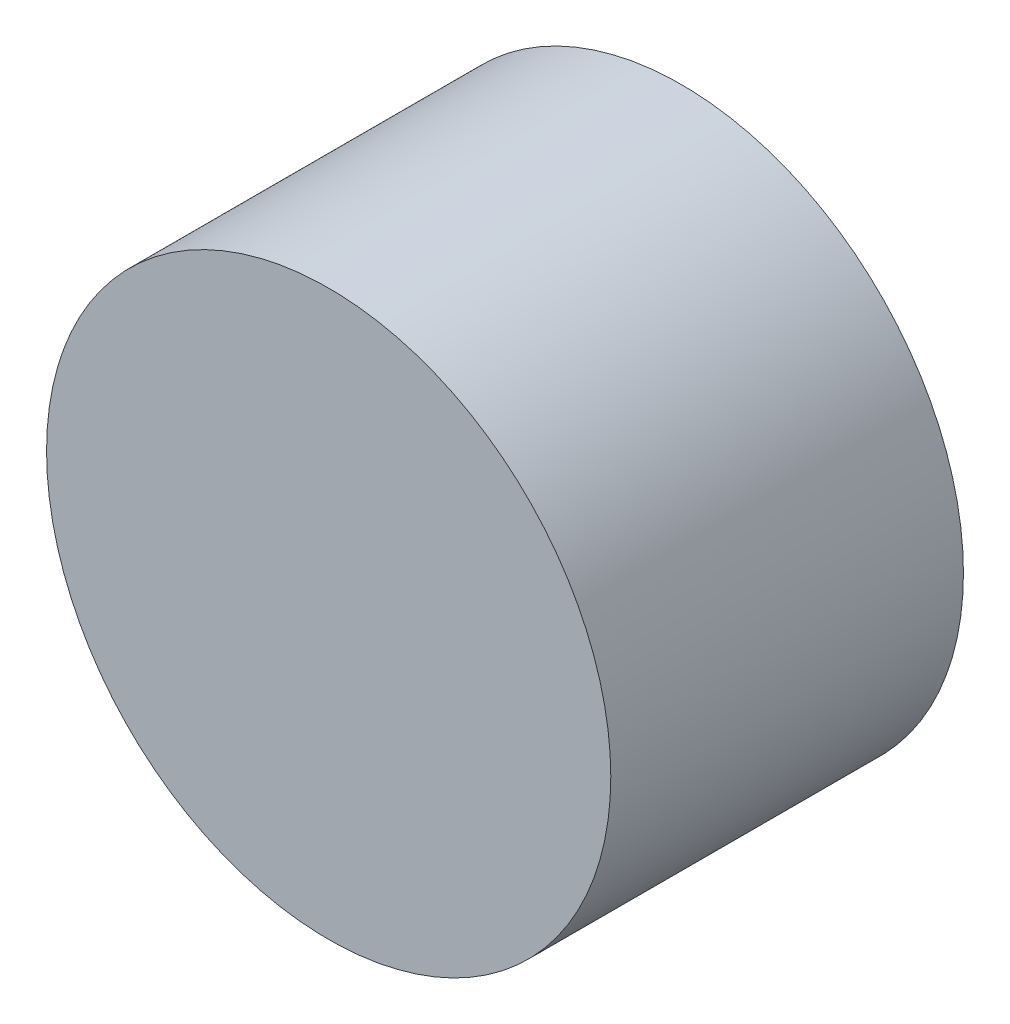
ISO-10303-21;
HEADER;
FILE_DESCRIPTION(('STEP AP214'),'2;1');
FILE_NAME('part.step','',(''),(''),'','','');
FILE_SCHEMA(('AUTOMOTIVE_DESIGN { 1 0 10303 214 1 1 1 1 }'));
ENDSEC;
DATA;
#1=APPLICATION_CONTEXT('core data for automotive mechanical design processes');
#2=APPLICATION_PROTOCOL_DEFINITION('international standard','automotive_design',2000,#1);
#3=PRODUCT_CONTEXT('',#1,'mechanical');
#4=PRODUCT('Part','Part','',(#3));
#5=PRODUCT_RELATED_PRODUCT_CATEGORY('part','',(#4));
#6=PRODUCT_DEFINITION_FORMATION('','',#4);
#7=PRODUCT_DEFINITION_CONTEXT('part definition',#1,'design');
#8=PRODUCT_DEFINITION('design','',#6,#7);
#9=PRODUCT_DEFINITION_SHAPE('','',#8);
#10=(LENGTH_UNIT() NAMED_UNIT(*) SI_UNIT(.MILLI.,.METRE.));
#11=(NAMED_UNIT(*) PLANE_ANGLE_UNIT() SI_UNIT($,.RADIAN.));
#12=(NAMED_UNIT(*) SI_UNIT($,.STERADIAN.) SOLID_ANGLE_UNIT());
#13=UNCERTAINTY_MEASURE_WITH_UNIT(LENGTH_MEASURE(1.E-05),#10,'distance_accuracy_value','');
#14=(GEOMETRIC_REPRESENTATION_CONTEXT(3) GLOBAL_UNCERTAINTY_ASSIGNED_CONTEXT((#13)) GLOBAL_UNIT_ASSIGNED_CONTEXT((#10,
#11,#12)) REPRESENTATION_CONTEXT('',''));
#15=CARTESIAN_POINT('',(0.,0.,0.));
#16=DIRECTION('',(0.,0.,1.));
#17=DIRECTION('',(1.,0.,0.));
#18=AXIS2_PLACEMENT_3D('',#15,#16,#17);
#19=CARTESIAN_POINT('',(0.,0.,0.));
#20=DIRECTION('',(0.,0.,1.));
#21=DIRECTION('',(1.,0.,0.));
#22=AXIS2_PLACEMENT_3D('',#19,#20,#21);
#23=PLANE('',#22);
#24=CARTESIAN_POINT('',(0.,0.,0.));
#25=DIRECTION('',(0.,0.,1.));
#26=DIRECTION('',(1.,0.,0.));
#27=AXIS2_PLACEMENT_3D('',#24,#25,#26);
#28=CIRCLE('',#27,20.);
#29=CARTESIAN_POINT('',(20.,0.,0.));
#30=VERTEX_POINT('',#29);
#31=EDGE_CURVE('E10',#30,#30,#28,.T.);
#32=ORIENTED_EDGE('',*,*,#31,.F.);
#33=EDGE_LOOP('',(#32));
#34=FACE_BOUND('',#33,.T.);
#35=CARTESIAN_POINT('',(0.,15.,0.));
#36=DIRECTION('',(0.,0.,1.));
#37=DIRECTION('',(1.,0.,0.));
#38=AXIS2_PLACEMENT_3D('',#35,#36,#37);
#39=CIRCLE('',#38,2.5);
#40=CARTESIAN_POINT('',(2.5,15.,0.));
#41=VERTEX_POINT('',#40);
#42=EDGE_CURVE('E39',#41,#41,#39,.T.);
#43=ORIENTED_EDGE('',*,*,#42,.T.);
#44=EDGE_LOOP('',(#43));
#45=FACE_BOUND('',#44,.T.);
#46=CARTESIAN_POINT('',(0.,5.,0.));
#47=DIRECTION('',(0.,0.,1.));
#48=DIRECTION('',(1.,0.,0.));
#49=AXIS2_PLACEMENT_3D('',#46,#47,#48);
#50=CIRCLE('',#49,2.5);
#51=CARTESIAN_POINT('',(2.5,5.,0.));
#52=VERTEX_POINT('',#51);
#53=EDGE_CURVE('E43',#52,#52,#50,.T.);
#54=ORIENTED_EDGE('',*,*,#53,.T.);
#55=EDGE_LOOP('',(#54));
#56=FACE_BOUND('',#55,.T.);
#57=CARTESIAN_POINT('',(10.6066017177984,10.6066017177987,0.));
#58=DIRECTION('',(0.,0.,1.));
#59=DIRECTION('',(1.,0.,0.));
#60=AXIS2_PLACEMENT_3D('',#57,#58,#59);
#61=CIRCLE('',#60,2.50000000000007);
#62=CARTESIAN_POINT('',(13.1066017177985,10.6066017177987,0.));
#63=VERTEX_POINT('',#62);
#64=EDGE_CURVE('E47',#63,#63,#61,.T.);
#65=ORIENTED_EDGE('',*,*,#64,.T.);
#66=EDGE_LOOP('',(#65));
#67=FACE_BOUND('',#66,.T.);
#68=CARTESIAN_POINT('',(15.0000000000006,6.37821527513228E-13,0.));
#69=DIRECTION('',(0.,0.,1.));
#70=DIRECTION('',(1.,0.,0.));
#71=AXIS2_PLACEMENT_3D('',#68,#69,#70);
#72=CIRCLE('',#71,2.50000000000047);
#73=CARTESIAN_POINT('',(17.5000000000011,6.37821527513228E-13,0.));
#74=VERTEX_POINT('',#73);
#75=EDGE_CURVE('E60',#74,#74,#72,.T.);
#76=ORIENTED_EDGE('',*,*,#75,.T.);
#77=EDGE_LOOP('',(#76));
#78=FACE_BOUND('',#77,.T.);
#79=CARTESIAN_POINT('',(10.6066017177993,-10.6066017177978,0.));
#80=DIRECTION('',(0.,0.,1.));
#81=DIRECTION('',(1.,0.,0.));
#82=AXIS2_PLACEMENT_3D('',#79,#80,#81);
#83=CIRCLE('',#82,2.50000000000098);
#84=CARTESIAN_POINT('',(13.1066017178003,-10.6066017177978,0.));
#85=VERTEX_POINT('',#84);
#86=EDGE_CURVE('E66',#85,#85,#83,.T.);
#87=ORIENTED_EDGE('',*,*,#86,.T.);
#88=EDGE_LOOP('',(#87));
#89=FACE_BOUND('',#88,.T.);
#90=CARTESIAN_POINT('',(1.27564305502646E-12,-15.,0.));
#91=DIRECTION('',(0.,0.,1.));
#92=DIRECTION('',(1.,0.,0.));
#93=AXIS2_PLACEMENT_3D('',#90,#91,#92);
#94=CIRCLE('',#93,2.50000000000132);
#95=CARTESIAN_POINT('',(2.50000000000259,-15.,0.));
#96=VERTEX_POINT('',#95);
#97=EDGE_CURVE('E72',#96,#96,#94,.T.);
#98=ORIENTED_EDGE('',*,*,#97,.T.);
#99=EDGE_LOOP('',(#98));
#100=FACE_BOUND('',#99,.T.);
#101=CARTESIAN_POINT('',(-10.6066017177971,-10.6066017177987,0.));
#102=DIRECTION('',(0.,0.,1.));
#103=DIRECTION('',(1.,0.,0.));
#104=AXIS2_PLACEMENT_3D('',#101,#102,#103);
#105=CIRCLE('',#104,2.5000000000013);
#106=CARTESIAN_POINT('',(-8.10660171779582,-10.6066017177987,0.));
#107=VERTEX_POINT('',#106);
#108=EDGE_CURVE('E78',#107,#107,#105,.T.);
#109=ORIENTED_EDGE('',*,*,#108,.T.);
#110=EDGE_LOOP('',(#109));
#111=FACE_BOUND('',#110,.T.);
#112=CARTESIAN_POINT('',(-14.9999999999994,-6.39658497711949E-13,0.));
#113=DIRECTION('',(0.,0.,1.));
#114=DIRECTION('',(1.,0.,0.));
#115=AXIS2_PLACEMENT_3D('',#112,#113,#114);
#116=CIRCLE('',#115,2.50000000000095);
#117=CARTESIAN_POINT('',(-12.4999999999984,-6.39658497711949E-13,0.));
#118=VERTEX_POINT('',#117);
#119=EDGE_CURVE('E84',#118,#118,#116,.T.);
#120=ORIENTED_EDGE('',*,*,#119,.T.);
#121=EDGE_LOOP('',(#120));
#122=FACE_BOUND('',#121,.T.);
#123=CARTESIAN_POINT('',(-10.606601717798,10.6066017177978,0.));
#124=DIRECTION('',(0.,0.,1.));
#125=DIRECTION('',(1.,0.,0.));
#126=AXIS2_PLACEMENT_3D('',#123,#124,#125);
#127=CIRCLE('',#126,2.50000000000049);
#128=CARTESIAN_POINT('',(-8.10660171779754,10.6066017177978,0.));
#129=VERTEX_POINT('',#128);
#130=EDGE_CURVE('E90',#129,#129,#127,.T.);
#131=ORIENTED_EDGE('',*,*,#130,.T.);
#132=EDGE_LOOP('',(#131));
#133=FACE_BOUND('',#132,.T.);
#134=CARTESIAN_POINT('',(5.,0.,0.));
#135=DIRECTION('',(0.,0.,1.));
#136=DIRECTION('',(1.,0.,0.));
#137=AXIS2_PLACEMENT_3D('',#134,#135,#136);
#138=CIRCLE('',#137,2.5);
#139=CARTESIAN_POINT('',(7.5,0.,0.));
#140=VERTEX_POINT('',#139);
#141=EDGE_CURVE('E96',#140,#140,#138,.T.);
#142=ORIENTED_EDGE('',*,*,#141,.T.);
#143=EDGE_LOOP('',(#142));
#144=FACE_BOUND('',#143,.T.);
#145=CARTESIAN_POINT('',(0.,-5.,0.));
#146=DIRECTION('',(0.,0.,1.));
#147=DIRECTION('',(1.,0.,0.));
#148=AXIS2_PLACEMENT_3D('',#145,#146,#147);
#149=CIRCLE('',#148,2.5);
#150=CARTESIAN_POINT('',(2.49999999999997,-5.,0.));
#151=VERTEX_POINT('',#150);
#152=EDGE_CURVE('E102',#151,#151,#149,.T.);
#153=ORIENTED_EDGE('',*,*,#152,.T.);
#154=EDGE_LOOP('',(#153));
#155=FACE_BOUND('',#154,.T.);
#156=CARTESIAN_POINT('',(-5.,0.,0.));
#157=DIRECTION('',(0.,0.,1.));
#158=DIRECTION('',(1.,0.,0.));
#159=AXIS2_PLACEMENT_3D('',#156,#157,#158);
#160=CIRCLE('',#159,2.5);
#161=CARTESIAN_POINT('',(-2.5,0.,0.));
#162=VERTEX_POINT('',#161);
#163=EDGE_CURVE('E108',#162,#162,#160,.T.);
#164=ORIENTED_EDGE('',*,*,#163,.T.);
#165=EDGE_LOOP('',(#164));
#166=FACE_BOUND('',#165,.T.);
#167=ADVANCED_FACE('F32',(#34,#45,#56,#67,#78,#89,#100,#111,#122,#133,#144,#155,#166),#23,.F.);
#168=CARTESIAN_POINT('',(0.,0.,10.));
#169=DIRECTION('',(0.,0.,-1.));
#170=DIRECTION('',(-1.,0.,0.));
#171=AXIS2_PLACEMENT_3D('',#168,#169,#170);
#172=CYLINDRICAL_SURFACE('',#171,20.);
#173=ORIENTED_EDGE('',*,*,#31,.T.);
#174=EDGE_LOOP('',(#173));
#175=FACE_BOUND('',#174,.T.);
#176=CARTESIAN_POINT('',(0.,0.,25.));
#177=DIRECTION('',(0.,0.,1.));
#178=DIRECTION('',(1.,0.,0.));
#179=AXIS2_PLACEMENT_3D('',#176,#177,#178);
#180=CIRCLE('',#179,20.);
#181=CARTESIAN_POINT('',(20.,0.,25.));
#182=VERTEX_POINT('',#181);
#183=EDGE_CURVE('E115',#182,#182,#180,.T.);
#184=ORIENTED_EDGE('',*,*,#183,.F.);
#185=EDGE_LOOP('',(#184));
#186=FACE_BOUND('',#185,.T.);
#187=ADVANCED_FACE('F34',(#175,#186),#172,.T.);
#188=CARTESIAN_POINT('',(0.,15.,10.));
#189=DIRECTION('',(0.,0.,-1.));
#190=DIRECTION('',(-1.,0.,0.));
#191=AXIS2_PLACEMENT_3D('',#188,#189,#190);
#192=CYLINDRICAL_SURFACE('',#191,2.5);
#193=CARTESIAN_POINT('',(0.,15.,10.));
#194=DIRECTION('',(0.,0.,1.));
#195=DIRECTION('',(1.,0.,0.));
#196=AXIS2_PLACEMENT_3D('',#193,#194,#195);
#197=CIRCLE('',#196,2.5);
#198=CARTESIAN_POINT('',(2.5,15.,10.));
#199=VERTEX_POINT('',#198);
#200=EDGE_CURVE('E50',#199,#199,#197,.T.);
#201=ORIENTED_EDGE('',*,*,#200,.T.);
#202=EDGE_LOOP('',(#201));
#203=FACE_BOUND('',#202,.T.);
#204=ORIENTED_EDGE('',*,*,#42,.F.);
#205=EDGE_LOOP('',(#204));
#206=FACE_BOUND('',#205,.T.);
#207=ADVANCED_FACE('F122',(#203,#206),#192,.F.);
#208=CARTESIAN_POINT('',(0.,5.,10.));
#209=DIRECTION('',(0.,0.,-1.));
#210=DIRECTION('',(-1.,0.,0.));
#211=AXIS2_PLACEMENT_3D('',#208,#209,#210);
#212=CYLINDRICAL_SURFACE('',#211,2.5);
#213=CARTESIAN_POINT('',(0.,5.,10.));
#214=DIRECTION('',(0.,0.,1.));
#215=DIRECTION('',(1.,0.,0.));
#216=AXIS2_PLACEMENT_3D('',#213,#214,#215);
#217=CIRCLE('',#216,2.5);
#218=CARTESIAN_POINT('',(2.5,5.,10.));
#219=VERTEX_POINT('',#218);
#220=EDGE_CURVE('E53',#219,#219,#217,.T.);
#221=ORIENTED_EDGE('',*,*,#220,.T.);
#222=EDGE_LOOP('',(#221));
#223=FACE_BOUND('',#222,.T.);
#224=ORIENTED_EDGE('',*,*,#53,.F.);
#225=EDGE_LOOP('',(#224));
#226=FACE_BOUND('',#225,.T.);
#227=ADVANCED_FACE('F127',(#223,#226),#212,.F.);
#228=CARTESIAN_POINT('',(10.6066017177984,10.6066017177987,10.));
#229=DIRECTION('',(0.,0.,-1.));
#230=DIRECTION('',(-1.,0.,0.));
#231=AXIS2_PLACEMENT_3D('',#228,#229,#230);
#232=CYLINDRICAL_SURFACE('',#231,2.50000000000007);
#233=CARTESIAN_POINT('',(10.6066017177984,10.6066017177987,10.));
#234=DIRECTION('',(0.,0.,1.));
#235=DIRECTION('',(1.,0.,0.));
#236=AXIS2_PLACEMENT_3D('',#233,#234,#235);
#237=CIRCLE('',#236,2.50000000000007);
#238=CARTESIAN_POINT('',(13.1066017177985,10.6066017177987,10.));
#239=VERTEX_POINT('',#238);
#240=EDGE_CURVE('E52',#239,#239,#237,.T.);
#241=ORIENTED_EDGE('',*,*,#240,.T.);
#242=EDGE_LOOP('',(#241));
#243=FACE_BOUND('',#242,.T.);
#244=ORIENTED_EDGE('',*,*,#64,.F.);
#245=EDGE_LOOP('',(#244));
#246=FACE_BOUND('',#245,.T.);
#247=ADVANCED_FACE('F136',(#243,#246),#232,.F.);
#248=CARTESIAN_POINT('',(15.0000000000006,6.37821527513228E-13,10.));
#249=DIRECTION('',(0.,0.,-1.));
#250=DIRECTION('',(-1.,0.,0.));
#251=AXIS2_PLACEMENT_3D('',#248,#249,#250);
#252=CYLINDRICAL_SURFACE('',#251,2.50000000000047);
#253=CARTESIAN_POINT('',(15.0000000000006,6.37821527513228E-13,10.));
#254=DIRECTION('',(0.,0.,1.));
#255=DIRECTION('',(1.,0.,0.));
#256=AXIS2_PLACEMENT_3D('',#253,#254,#255);
#257=CIRCLE('',#256,2.50000000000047);
#258=CARTESIAN_POINT('',(17.5000000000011,6.37821527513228E-13,10.));
#259=VERTEX_POINT('',#258);
#260=EDGE_CURVE('E57',#259,#259,#257,.T.);
#261=ORIENTED_EDGE('',*,*,#260,.T.);
#262=EDGE_LOOP('',(#261));
#263=FACE_BOUND('',#262,.T.);
#264=ORIENTED_EDGE('',*,*,#75,.F.);
#265=EDGE_LOOP('',(#264));
#266=FACE_BOUND('',#265,.T.);
#267=ADVANCED_FACE('F140',(#263,#266),#252,.F.);
#268=CARTESIAN_POINT('',(10.6066017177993,-10.6066017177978,10.));
#269=DIRECTION('',(0.,0.,-1.));
#270=DIRECTION('',(-1.,0.,0.));
#271=AXIS2_PLACEMENT_3D('',#268,#269,#270);
#272=CYLINDRICAL_SURFACE('',#271,2.50000000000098);
#273=CARTESIAN_POINT('',(10.6066017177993,-10.6066017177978,10.));
#274=DIRECTION('',(0.,0.,1.));
#275=DIRECTION('',(1.,0.,0.));
#276=AXIS2_PLACEMENT_3D('',#273,#274,#275);
#277=CIRCLE('',#276,2.50000000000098);
#278=CARTESIAN_POINT('',(13.1066017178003,-10.6066017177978,10.));
#279=VERTEX_POINT('',#278);
#280=EDGE_CURVE('E63',#279,#279,#277,.T.);
#281=ORIENTED_EDGE('',*,*,#280,.T.);
#282=EDGE_LOOP('',(#281));
#283=FACE_BOUND('',#282,.T.);
#284=ORIENTED_EDGE('',*,*,#86,.F.);
#285=EDGE_LOOP('',(#284));
#286=FACE_BOUND('',#285,.T.);
#287=ADVANCED_FACE('F144',(#283,#286),#272,.F.);
#288=CARTESIAN_POINT('',(1.27564305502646E-12,-15.,10.));
#289=DIRECTION('',(0.,0.,-1.));
#290=DIRECTION('',(-1.,0.,0.));
#291=AXIS2_PLACEMENT_3D('',#288,#289,#290);
#292=CYLINDRICAL_SURFACE('',#291,2.50000000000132);
#293=CARTESIAN_POINT('',(1.27564305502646E-12,-15.,10.));
#294=DIRECTION('',(0.,0.,1.));
#295=DIRECTION('',(1.,0.,0.));
#296=AXIS2_PLACEMENT_3D('',#293,#294,#295);
#297=CIRCLE('',#296,2.50000000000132);
#298=CARTESIAN_POINT('',(2.50000000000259,-15.,10.));
#299=VERTEX_POINT('',#298);
#300=EDGE_CURVE('E69',#299,#299,#297,.T.);
#301=ORIENTED_EDGE('',*,*,#300,.T.);
#302=EDGE_LOOP('',(#301));
#303=FACE_BOUND('',#302,.T.);
#304=ORIENTED_EDGE('',*,*,#97,.F.);
#305=EDGE_LOOP('',(#304));
#306=FACE_BOUND('',#305,.T.);
#307=ADVANCED_FACE('F148',(#303,#306),#292,.F.);
#308=CARTESIAN_POINT('',(-10.6066017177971,-10.6066017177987,10.));
#309=DIRECTION('',(0.,0.,-1.));
#310=DIRECTION('',(-1.,0.,0.));
#311=AXIS2_PLACEMENT_3D('',#308,#309,#310);
#312=CYLINDRICAL_SURFACE('',#311,2.5000000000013);
#313=CARTESIAN_POINT('',(-10.6066017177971,-10.6066017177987,10.));
#314=DIRECTION('',(0.,0.,1.));
#315=DIRECTION('',(1.,0.,0.));
#316=AXIS2_PLACEMENT_3D('',#313,#314,#315);
#317=CIRCLE('',#316,2.5000000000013);
#318=CARTESIAN_POINT('',(-8.10660171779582,-10.6066017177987,10.));
#319=VERTEX_POINT('',#318);
#320=EDGE_CURVE('E75',#319,#319,#317,.T.);
#321=ORIENTED_EDGE('',*,*,#320,.T.);
#322=EDGE_LOOP('',(#321));
#323=FACE_BOUND('',#322,.T.);
#324=ORIENTED_EDGE('',*,*,#108,.F.);
#325=EDGE_LOOP('',(#324));
#326=FACE_BOUND('',#325,.T.);
#327=ADVANCED_FACE('F152',(#323,#326),#312,.F.);
#328=CARTESIAN_POINT('',(-14.9999999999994,-6.39658497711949E-13,10.));
#329=DIRECTION('',(0.,0.,-1.));
#330=DIRECTION('',(-1.,0.,0.));
#331=AXIS2_PLACEMENT_3D('',#328,#329,#330);
#332=CYLINDRICAL_SURFACE('',#331,2.50000000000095);
#333=CARTESIAN_POINT('',(-14.9999999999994,-6.39658497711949E-13,10.));
#334=DIRECTION('',(0.,0.,1.));
#335=DIRECTION('',(1.,0.,0.));
#336=AXIS2_PLACEMENT_3D('',#333,#334,#335);
#337=CIRCLE('',#336,2.50000000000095);
#338=CARTESIAN_POINT('',(-12.4999999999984,-6.39658497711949E-13,10.));
#339=VERTEX_POINT('',#338);
#340=EDGE_CURVE('E81',#339,#339,#337,.T.);
#341=ORIENTED_EDGE('',*,*,#340,.T.);
#342=EDGE_LOOP('',(#341));
#343=FACE_BOUND('',#342,.T.);
#344=ORIENTED_EDGE('',*,*,#119,.F.);
#345=EDGE_LOOP('',(#344));
#346=FACE_BOUND('',#345,.T.);
#347=ADVANCED_FACE('F156',(#343,#346),#332,.F.);
#348=CARTESIAN_POINT('',(-10.606601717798,10.6066017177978,10.));
#349=DIRECTION('',(0.,0.,-1.));
#350=DIRECTION('',(-1.,0.,0.));
#351=AXIS2_PLACEMENT_3D('',#348,#349,#350);
#352=CYLINDRICAL_SURFACE('',#351,2.50000000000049);
#353=CARTESIAN_POINT('',(-10.606601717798,10.6066017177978,10.));
#354=DIRECTION('',(0.,0.,1.));
#355=DIRECTION('',(1.,0.,0.));
#356=AXIS2_PLACEMENT_3D('',#353,#354,#355);
#357=CIRCLE('',#356,2.50000000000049);
#358=CARTESIAN_POINT('',(-8.10660171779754,10.6066017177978,10.));
#359=VERTEX_POINT('',#358);
#360=EDGE_CURVE('E87',#359,#359,#357,.T.);
#361=ORIENTED_EDGE('',*,*,#360,.T.);
#362=EDGE_LOOP('',(#361));
#363=FACE_BOUND('',#362,.T.);
#364=ORIENTED_EDGE('',*,*,#130,.F.);
#365=EDGE_LOOP('',(#364));
#366=FACE_BOUND('',#365,.T.);
#367=ADVANCED_FACE('F160',(#363,#366),#352,.F.);
#368=CARTESIAN_POINT('',(5.,0.,10.));
#369=DIRECTION('',(0.,0.,-1.));
#370=DIRECTION('',(-1.,0.,0.));
#371=AXIS2_PLACEMENT_3D('',#368,#369,#370);
#372=CYLINDRICAL_SURFACE('',#371,2.5);
#373=CARTESIAN_POINT('',(5.,0.,10.));
#374=DIRECTION('',(0.,0.,1.));
#375=DIRECTION('',(1.,0.,0.));
#376=AXIS2_PLACEMENT_3D('',#373,#374,#375);
#377=CIRCLE('',#376,2.5);
#378=CARTESIAN_POINT('',(7.5,0.,10.));
#379=VERTEX_POINT('',#378);
#380=EDGE_CURVE('E93',#379,#379,#377,.T.);
#381=ORIENTED_EDGE('',*,*,#380,.T.);
#382=EDGE_LOOP('',(#381));
#383=FACE_BOUND('',#382,.T.);
#384=ORIENTED_EDGE('',*,*,#141,.F.);
#385=EDGE_LOOP('',(#384));
#386=FACE_BOUND('',#385,.T.);
#387=ADVANCED_FACE('F164',(#383,#386),#372,.F.);
#388=CARTESIAN_POINT('',(0.,-5.,10.));
#389=DIRECTION('',(0.,0.,-1.));
#390=DIRECTION('',(-1.,0.,0.));
#391=AXIS2_PLACEMENT_3D('',#388,#389,#390);
#392=CYLINDRICAL_SURFACE('',#391,2.5);
#393=CARTESIAN_POINT('',(0.,-5.,10.));
#394=DIRECTION('',(0.,0.,1.));
#395=DIRECTION('',(1.,0.,0.));
#396=AXIS2_PLACEMENT_3D('',#393,#394,#395);
#397=CIRCLE('',#396,2.5);
#398=CARTESIAN_POINT('',(2.49999999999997,-5.,10.));
#399=VERTEX_POINT('',#398);
#400=EDGE_CURVE('E99',#399,#399,#397,.T.);
#401=ORIENTED_EDGE('',*,*,#400,.T.);
#402=EDGE_LOOP('',(#401));
#403=FACE_BOUND('',#402,.T.);
#404=ORIENTED_EDGE('',*,*,#152,.F.);
#405=EDGE_LOOP('',(#404));
#406=FACE_BOUND('',#405,.T.);
#407=ADVANCED_FACE('F168',(#403,#406),#392,.F.);
#408=CARTESIAN_POINT('',(-5.,0.,10.));
#409=DIRECTION('',(0.,0.,-1.));
#410=DIRECTION('',(-1.,0.,0.));
#411=AXIS2_PLACEMENT_3D('',#408,#409,#410);
#412=CYLINDRICAL_SURFACE('',#411,2.5);
#413=CARTESIAN_POINT('',(-5.,0.,10.));
#414=DIRECTION('',(0.,0.,1.));
#415=DIRECTION('',(1.,0.,0.));
#416=AXIS2_PLACEMENT_3D('',#413,#414,#415);
#417=CIRCLE('',#416,2.5);
#418=CARTESIAN_POINT('',(-2.5,0.,10.));
#419=VERTEX_POINT('',#418);
#420=EDGE_CURVE('E105',#419,#419,#417,.T.);
#421=ORIENTED_EDGE('',*,*,#420,.T.);
#422=EDGE_LOOP('',(#421));
#423=FACE_BOUND('',#422,.T.);
#424=ORIENTED_EDGE('',*,*,#163,.F.);
#425=EDGE_LOOP('',(#424));
#426=FACE_BOUND('',#425,.T.);
#427=ADVANCED_FACE('F172',(#423,#426),#412,.F.);
#428=CARTESIAN_POINT('',(0.,0.,10.));
#429=DIRECTION('',(0.,0.,1.));
#430=DIRECTION('',(1.,0.,0.));
#431=AXIS2_PLACEMENT_3D('',#428,#429,#430);
#432=PLANE('',#431);
#433=ORIENTED_EDGE('',*,*,#420,.F.);
#434=EDGE_LOOP('',(#433));
#435=FACE_BOUND('',#434,.T.);
#436=ADVANCED_FACE('F176',(#435),#432,.F.);
#437=ORIENTED_EDGE('',*,*,#380,.F.);
#438=EDGE_LOOP('',(#437));
#439=FACE_BOUND('',#438,.T.);
#440=ADVANCED_FACE('F252',(#439),#432,.F.);
#441=ORIENTED_EDGE('',*,*,#340,.F.);
#442=EDGE_LOOP('',(#441));
#443=FACE_BOUND('',#442,.T.);
#444=ADVANCED_FACE('F245',(#443),#432,.F.);
#445=ORIENTED_EDGE('',*,*,#300,.F.);
#446=EDGE_LOOP('',(#445));
#447=FACE_BOUND('',#446,.T.);
#448=ADVANCED_FACE('F238',(#447),#432,.F.);
#449=ORIENTED_EDGE('',*,*,#260,.F.);
#450=EDGE_LOOP('',(#449));
#451=FACE_BOUND('',#450,.T.);
#452=ADVANCED_FACE('F231',(#451),#432,.F.);
#453=ORIENTED_EDGE('',*,*,#220,.F.);
#454=EDGE_LOOP('',(#453));
#455=FACE_BOUND('',#454,.T.);
#456=ADVANCED_FACE('F224',(#455),#432,.F.);
#457=ORIENTED_EDGE('',*,*,#200,.F.);
#458=EDGE_LOOP('',(#457));
#459=FACE_BOUND('',#458,.T.);
#460=ADVANCED_FACE('F217',(#459),#432,.F.);
#461=ORIENTED_EDGE('',*,*,#240,.F.);
#462=EDGE_LOOP('',(#461));
#463=FACE_BOUND('',#462,.T.);
#464=ADVANCED_FACE('F210',(#463),#432,.F.);
#465=ORIENTED_EDGE('',*,*,#280,.F.);
#466=EDGE_LOOP('',(#465));
#467=FACE_BOUND('',#466,.T.);
#468=ADVANCED_FACE('F203',(#467),#432,.F.);
#469=ORIENTED_EDGE('',*,*,#320,.F.);
#470=EDGE_LOOP('',(#469));
#471=FACE_BOUND('',#470,.T.);
#472=ADVANCED_FACE('F196',(#471),#432,.F.);
#473=ORIENTED_EDGE('',*,*,#360,.F.);
#474=EDGE_LOOP('',(#473));
#475=FACE_BOUND('',#474,.T.);
#476=ADVANCED_FACE('F181',(#475),#432,.F.);
#477=ORIENTED_EDGE('',*,*,#400,.F.);
#478=EDGE_LOOP('',(#477));
#479=FACE_BOUND('',#478,.T.);
#480=ADVANCED_FACE('F178',(#479),#432,.F.);
#481=CARTESIAN_POINT('',(0.,0.,25.));
#482=DIRECTION('',(0.,0.,1.));
#483=DIRECTION('',(1.,0.,0.));
#484=AXIS2_PLACEMENT_3D('',#481,#482,#483);
#485=PLANE('',#484);
#486=ORIENTED_EDGE('',*,*,#183,.T.);
#487=EDGE_LOOP('',(#486));
#488=FACE_BOUND('',#487,.T.);
#489=ADVANCED_FACE('F119',(#488),#485,.T.);
#490=CLOSED_SHELL('',(#167,#187,#207,#227,#247,#267,#287,#307,#327,#347,#367,#387,#407,#427,
#436,#440,#444,#448,#452,#456,#460,#464,#468,#472,#476,#480,#489));
#491=MANIFOLD_SOLID_BREP('B2',#490);
#492=ADVANCED_BREP_SHAPE_REPRESENTATION('',(#18,#491),#14);
#493=SHAPE_DEFINITION_REPRESENTATION(#9,#492);
ENDSEC;
END-ISO-10303-21;
